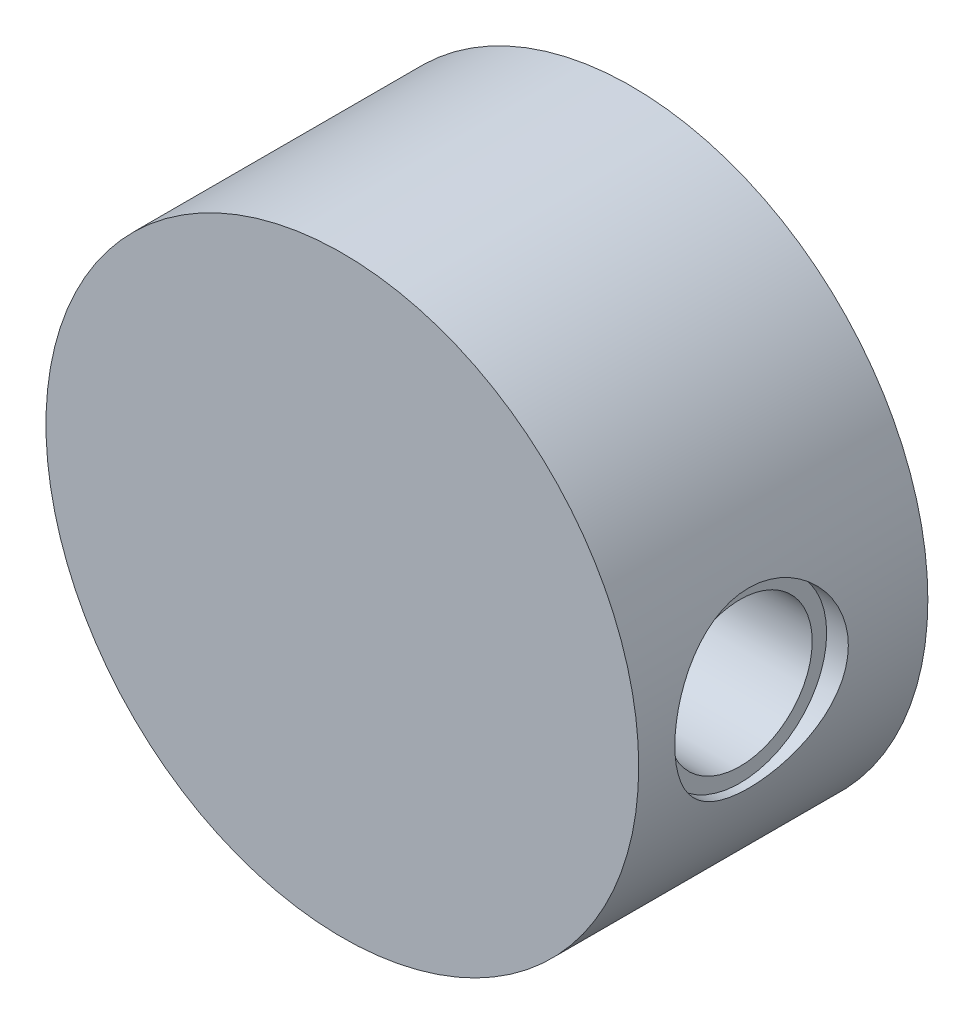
ISO-10303-21;
HEADER;
FILE_DESCRIPTION(('STEP AP214'),'2;1');
FILE_NAME('part.step','',(''),(''),'','','');
FILE_SCHEMA(('AUTOMOTIVE_DESIGN { 1 0 10303 214 1 1 1 1 }'));
ENDSEC;
DATA;
#1=APPLICATION_CONTEXT('core data for automotive mechanical design processes');
#2=APPLICATION_PROTOCOL_DEFINITION('international standard','automotive_design',2000,#1);
#3=PRODUCT_CONTEXT('',#1,'mechanical');
#4=PRODUCT('Part','Part','',(#3));
#5=PRODUCT_RELATED_PRODUCT_CATEGORY('part','',(#4));
#6=PRODUCT_DEFINITION_FORMATION('','',#4);
#7=PRODUCT_DEFINITION_CONTEXT('part definition',#1,'design');
#8=PRODUCT_DEFINITION('design','',#6,#7);
#9=PRODUCT_DEFINITION_SHAPE('','',#8);
#10=(LENGTH_UNIT() NAMED_UNIT(*) SI_UNIT(.MILLI.,.METRE.));
#11=(NAMED_UNIT(*) PLANE_ANGLE_UNIT() SI_UNIT($,.RADIAN.));
#12=(NAMED_UNIT(*) SI_UNIT($,.STERADIAN.) SOLID_ANGLE_UNIT());
#13=UNCERTAINTY_MEASURE_WITH_UNIT(LENGTH_MEASURE(1.E-05),#10,'distance_accuracy_value','');
#14=(GEOMETRIC_REPRESENTATION_CONTEXT(3) GLOBAL_UNCERTAINTY_ASSIGNED_CONTEXT((#13)) GLOBAL_UNIT_ASSIGNED_CONTEXT((#10,
#11,#12)) REPRESENTATION_CONTEXT('',''));
#15=CARTESIAN_POINT('',(0.,0.,0.));
#16=DIRECTION('',(0.,0.,1.));
#17=DIRECTION('',(1.,0.,0.));
#18=AXIS2_PLACEMENT_3D('',#15,#16,#17);
#19=CARTESIAN_POINT('',(0.,0.,0.));
#20=DIRECTION('',(0.,0.,1.));
#21=DIRECTION('',(1.,0.,0.));
#22=AXIS2_PLACEMENT_3D('',#19,#20,#21);
#23=PLANE('',#22);
#24=CARTESIAN_POINT('',(0.,0.,0.));
#25=DIRECTION('',(0.,0.,1.));
#26=DIRECTION('',(1.,0.,0.));
#27=AXIS2_PLACEMENT_3D('',#24,#25,#26);
#28=CIRCLE('',#27,9.5);
#29=CARTESIAN_POINT('',(9.5,0.,0.));
#30=VERTEX_POINT('',#29);
#31=EDGE_CURVE('E8',#30,#30,#28,.T.);
#32=ORIENTED_EDGE('',*,*,#31,.F.);
#33=EDGE_LOOP('',(#32));
#34=FACE_BOUND('',#33,.T.);
#35=CARTESIAN_POINT('',(0.,0.,0.));
#36=DIRECTION('',(0.,0.,-1.));
#37=DIRECTION('',(-1.,0.,0.));
#38=AXIS2_PLACEMENT_3D('',#35,#36,#37);
#39=CIRCLE('',#38,6.);
#40=CARTESIAN_POINT('',(-6.,0.,0.));
#41=VERTEX_POINT('',#40);
#42=EDGE_CURVE('E37',#41,#41,#39,.T.);
#43=ORIENTED_EDGE('',*,*,#42,.F.);
#44=EDGE_LOOP('',(#43));
#45=FACE_BOUND('',#44,.T.);
#46=ADVANCED_FACE('F12',(#34,#45),#23,.F.);
#47=CARTESIAN_POINT('',(0.,0.,40.));
#48=DIRECTION('',(0.,0.,1.));
#49=DIRECTION('',(1.,0.,0.));
#50=AXIS2_PLACEMENT_3D('',#47,#48,#49);
#51=CYLINDRICAL_SURFACE('',#50,9.5);
#52=CARTESIAN_POINT('',(0.,0.,2.));
#53=DIRECTION('',(0.,0.,1.));
#54=DIRECTION('',(1.,0.,0.));
#55=AXIS2_PLACEMENT_3D('',#52,#53,#54);
#56=CIRCLE('',#55,9.5);
#57=CARTESIAN_POINT('',(9.5,0.,2.));
#58=VERTEX_POINT('',#57);
#59=EDGE_CURVE('E34',#58,#58,#56,.T.);
#60=ORIENTED_EDGE('',*,*,#59,.F.);
#61=EDGE_LOOP('',(#60));
#62=FACE_BOUND('',#61,.T.);
#63=ORIENTED_EDGE('',*,*,#31,.T.);
#64=EDGE_LOOP('',(#63));
#65=FACE_BOUND('',#64,.T.);
#66=ADVANCED_FACE('F14',(#62,#65),#51,.T.);
#67=CARTESIAN_POINT('',(20.5,0.,22.));
#68=DIRECTION('',(0.,0.,-1.));
#69=DIRECTION('',(-1.,0.,0.));
#70=AXIS2_PLACEMENT_3D('',#67,#68,#69);
#71=PLANE('',#70);
#72=CARTESIAN_POINT('',(0.,0.,22.));
#73=DIRECTION('',(0.,0.,1.));
#74=DIRECTION('',(1.,0.,0.));
#75=AXIS2_PLACEMENT_3D('',#72,#73,#74);
#76=CIRCLE('',#75,20.5);
#77=CARTESIAN_POINT('',(20.5,0.,22.));
#78=VERTEX_POINT('',#77);
#79=EDGE_CURVE('E25',#78,#78,#76,.T.);
#80=ORIENTED_EDGE('',*,*,#79,.T.);
#81=EDGE_LOOP('',(#80));
#82=FACE_BOUND('',#81,.T.);
#83=ADVANCED_FACE('F73',(#82),#71,.F.);
#84=CARTESIAN_POINT('',(0.,0.,40.));
#85=DIRECTION('',(0.,0.,1.));
#86=DIRECTION('',(1.,0.,0.));
#87=AXIS2_PLACEMENT_3D('',#84,#85,#86);
#88=CYLINDRICAL_SURFACE('',#87,20.5);
#89=CARTESIAN_POINT('',(20.5,0.,7.5));
#90=CARTESIAN_POINT('',(20.4999997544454,-0.164768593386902,7.50000038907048));
#91=CARTESIAN_POINT('',(20.4980087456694,-0.329544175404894,7.50679278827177));
#92=CARTESIAN_POINT('',(20.4900990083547,-0.65788822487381,7.5339021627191));
#93=CARTESIAN_POINT('',(20.4841800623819,-0.821456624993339,7.55421988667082));
#94=CARTESIAN_POINT('',(20.4685766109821,-1.1462122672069,7.60820100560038));
#95=CARTESIAN_POINT('',(20.4588916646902,-1.30739922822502,7.64186596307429));
#96=CARTESIAN_POINT('',(20.4360164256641,-1.62628314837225,7.72226244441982));
#97=CARTESIAN_POINT('',(20.4228249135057,-1.7839788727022,7.76899851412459));
#98=CARTESIAN_POINT('',(20.3933182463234,-2.09448185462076,7.87505403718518));
#99=CARTESIAN_POINT('',(20.3770082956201,-2.24729676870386,7.93435254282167));
#100=CARTESIAN_POINT('',(20.3416823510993,-2.54730770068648,8.06511256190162));
#101=CARTESIAN_POINT('',(20.3226662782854,-2.69450355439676,8.13657443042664));
#102=CARTESIAN_POINT('',(20.2824208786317,-2.98237032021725,8.2911456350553));
#103=CARTESIAN_POINT('',(20.2611910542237,-3.123039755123,8.37425759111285));
#104=CARTESIAN_POINT('',(20.2170775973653,-3.39691169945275,8.55150630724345));
#105=CARTESIAN_POINT('',(20.1941944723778,-3.53011647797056,8.6456396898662));
#106=CARTESIAN_POINT('',(20.146767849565,-3.79154794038,8.84682399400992));
#107=CARTESIAN_POINT('',(20.1221971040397,-3.91956600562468,8.95413966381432));
#108=CARTESIAN_POINT('',(20.0725990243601,-4.1661228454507,9.17897611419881));
#109=CARTESIAN_POINT('',(20.0475718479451,-4.2846648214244,9.29649342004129));
#110=CARTESIAN_POINT('',(19.9977175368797,-4.5116297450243,9.54108035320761));
#111=CARTESIAN_POINT('',(19.9728905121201,-4.62004743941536,9.66815487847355));
#112=CARTESIAN_POINT('',(19.9241410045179,-4.82595045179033,9.93095842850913));
#113=CARTESIAN_POINT('',(19.9002181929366,-4.92343976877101,10.0666842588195));
#114=CARTESIAN_POINT('',(19.8534354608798,-5.10885934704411,10.3490171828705));
#115=CARTESIAN_POINT('',(19.8306098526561,-5.19653638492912,10.4957964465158));
#116=CARTESIAN_POINT('',(19.7872868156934,-5.35913808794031,10.7965125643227));
#117=CARTESIAN_POINT('',(19.766788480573,-5.43406772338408,10.9504465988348));
#118=CARTESIAN_POINT('',(19.7287391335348,-5.57062666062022,11.2645036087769));
#119=CARTESIAN_POINT('',(19.7111887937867,-5.63225293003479,11.4246279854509));
#120=CARTESIAN_POINT('',(19.6796082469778,-5.74162541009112,11.7498143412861));
#121=CARTESIAN_POINT('',(19.6655765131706,-5.78937764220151,11.9148741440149));
#122=CARTESIAN_POINT('',(19.6418018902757,-5.86952471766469,12.2443484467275));
#123=CARTESIAN_POINT('',(19.6319555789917,-5.90229162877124,12.4086649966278));
#124=CARTESIAN_POINT('',(19.6163432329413,-5.95397424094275,12.7395899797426));
#125=CARTESIAN_POINT('',(19.6105755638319,-5.97289549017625,12.9061974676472));
#126=CARTESIAN_POINT('',(19.603301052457,-5.99672775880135,13.2405034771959));
#127=CARTESIAN_POINT('',(19.6017941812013,-6.00163887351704,13.4082019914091));
#128=CARTESIAN_POINT('',(19.6030905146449,-5.99740342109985,13.7434027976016));
#129=CARTESIAN_POINT('',(19.6058936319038,-5.98825713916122,13.9109050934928));
#130=CARTESIAN_POINT('',(19.6155486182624,-5.95655212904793,14.238688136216));
#131=CARTESIAN_POINT('',(19.6222578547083,-5.9344657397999,14.3990190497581));
#132=CARTESIAN_POINT('',(19.6394095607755,-5.87745500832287,14.7172343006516));
#133=CARTESIAN_POINT('',(19.649853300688,-5.84252629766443,14.8751177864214));
#134=CARTESIAN_POINT('',(19.6741615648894,-5.7601395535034,15.187257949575));
#135=CARTESIAN_POINT('',(19.688025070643,-5.71268525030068,15.3415156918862));
#136=CARTESIAN_POINT('',(19.7187796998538,-5.60560692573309,15.6454959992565));
#137=CARTESIAN_POINT('',(19.7356719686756,-5.5459782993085,15.7952168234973));
#138=CARTESIAN_POINT('',(19.7722410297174,-5.41416819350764,16.0910079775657));
#139=CARTESIAN_POINT('',(19.7919506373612,-5.34183608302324,16.2370072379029));
#140=CARTESIAN_POINT('',(19.8334359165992,-5.18568691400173,16.5224423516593));
#141=CARTESIAN_POINT('',(19.8552123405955,-5.10186566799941,16.6618757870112));
#142=CARTESIAN_POINT('',(19.9227548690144,-4.8340177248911,17.0689782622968));
#143=CARTESIAN_POINT('',(19.9707648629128,-4.63350124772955,17.3256854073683));
#144=CARTESIAN_POINT('',(20.0696162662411,-4.18511260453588,17.8126329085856));
#145=CARTESIAN_POINT('',(20.1204944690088,-3.93567819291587,18.0414205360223));
#146=CARTESIAN_POINT('',(20.2176813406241,-3.40132203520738,18.4542852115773));
#147=CARTESIAN_POINT('',(20.2639897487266,-3.11639826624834,18.63835970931));
#148=CARTESIAN_POINT('',(20.3472018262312,-2.51664006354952,18.9573414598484));
#149=CARTESIAN_POINT('',(20.3840462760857,-2.2016334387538,19.0919412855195));
#150=CARTESIAN_POINT('',(20.4437541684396,-1.55212614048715,19.3058343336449));
#151=CARTESIAN_POINT('',(20.4666213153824,-1.21763065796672,19.3851422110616));
#152=CARTESIAN_POINT('',(20.4952175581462,-0.550953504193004,19.4838192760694));
#153=CARTESIAN_POINT('',(20.5015074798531,-0.219085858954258,19.5051506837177));
#154=CARTESIAN_POINT('',(20.4978783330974,0.44350281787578,19.4927506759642));
#155=CARTESIAN_POINT('',(20.4879613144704,0.774223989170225,19.4590262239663));
#156=CARTESIAN_POINT('',(20.4533992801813,1.41781519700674,19.3390673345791));
#157=CARTESIAN_POINT('',(20.4290727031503,1.73091547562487,19.253967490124));
#158=CARTESIAN_POINT('',(20.3684901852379,2.33834273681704,19.0350155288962));
#159=CARTESIAN_POINT('',(20.3322328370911,2.63266749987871,18.901157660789));
#160=CARTESIAN_POINT('',(20.2505580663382,3.201467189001,18.585163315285));
#161=CARTESIAN_POINT('',(20.2049537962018,3.47535043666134,18.4020133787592));
#162=CARTESIAN_POINT('',(20.1098009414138,3.98926947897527,17.9937010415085));
#163=CARTESIAN_POINT('',(20.0602514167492,4.22929716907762,17.7685286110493));
#164=CARTESIAN_POINT('',(19.9860369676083,4.56311282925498,17.3996018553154));
#165=CARTESIAN_POINT('',(19.9608943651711,4.67160496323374,17.2689475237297));
#166=CARTESIAN_POINT('',(19.9116554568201,4.87720494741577,16.9988051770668));
#167=CARTESIAN_POINT('',(19.8875587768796,4.97431688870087,16.8593203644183));
#168=CARTESIAN_POINT('',(19.8411019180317,5.15650338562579,16.5723575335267));
#169=CARTESIAN_POINT('',(19.8187424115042,5.24157329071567,16.4248764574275));
#170=CARTESIAN_POINT('',(19.7764458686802,5.39896546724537,16.1230001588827));
#171=CARTESIAN_POINT('',(19.7565078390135,5.47129297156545,15.9686078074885));
#172=CARTESIAN_POINT('',(19.7197444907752,5.60234699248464,15.6546484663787));
#173=CARTESIAN_POINT('',(19.7029051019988,5.6611353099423,15.49510893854));
#174=CARTESIAN_POINT('',(19.6727610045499,5.76501533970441,15.1713718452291));
#175=CARTESIAN_POINT('',(19.6594548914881,5.81011249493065,15.0071761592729));
#176=CARTESIAN_POINT('',(19.6367999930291,5.88622676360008,14.675294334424));
#177=CARTESIAN_POINT('',(19.6274509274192,5.91724487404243,14.5076084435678));
#178=CARTESIAN_POINT('',(19.6130187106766,5.96490739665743,14.1700260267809));
#179=CARTESIAN_POINT('',(19.6079354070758,5.98155232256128,14.0001295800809));
#180=CARTESIAN_POINT('',(19.6023186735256,5.9999323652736,13.6662567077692));
#181=CARTESIAN_POINT('',(19.6016119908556,6.00223524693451,13.5023141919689));
#182=CARTESIAN_POINT('',(19.6043094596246,5.99341910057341,13.1747666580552));
#183=CARTESIAN_POINT('',(19.6077150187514,5.98229547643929,13.0111617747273));
#184=CARTESIAN_POINT('',(19.6185313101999,5.94672790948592,12.6856110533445));
#185=CARTESIAN_POINT('',(19.6259403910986,5.92228945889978,12.5236645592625));
#186=CARTESIAN_POINT('',(19.6445384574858,5.86030325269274,12.2024601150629));
#187=CARTESIAN_POINT('',(19.6557288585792,5.82275058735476,12.0432031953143));
#188=CARTESIAN_POINT('',(19.6814005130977,5.73537439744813,11.7303823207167));
#189=CARTESIAN_POINT('',(19.6958418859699,5.68569901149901,11.5767736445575));
#190=CARTESIAN_POINT('',(19.7276768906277,5.57423736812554,11.2742707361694));
#191=CARTESIAN_POINT('',(19.7450715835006,5.51244675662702,11.125378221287));
#192=CARTESIAN_POINT('',(19.782319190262,5.37724463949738,10.8333301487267));
#193=CARTESIAN_POINT('',(19.802171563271,5.30383568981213,10.6901733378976));
#194=CARTESIAN_POINT('',(19.8438063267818,5.14587421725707,10.4103722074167));
#195=CARTESIAN_POINT('',(19.8655894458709,5.061317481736,10.2737303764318));
#196=CARTESIAN_POINT('',(19.9112797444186,4.87853600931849,10.0032239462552));
#197=CARTESIAN_POINT('',(19.9352342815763,4.77994030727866,9.86961789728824));
#198=CARTESIAN_POINT('',(19.9839347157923,4.57206196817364,9.61107007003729));
#199=CARTESIAN_POINT('',(20.0086809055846,4.46277534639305,9.48613155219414));
#200=CARTESIAN_POINT('',(20.0582834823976,4.23425660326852,9.24575891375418));
#201=CARTESIAN_POINT('',(20.0831398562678,4.11502564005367,9.13032368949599));
#202=CARTESIAN_POINT('',(20.1323098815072,3.86730499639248,8.90963180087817));
#203=CARTESIAN_POINT('',(20.1566233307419,3.7388119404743,8.80437888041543));
#204=CARTESIAN_POINT('',(20.2046974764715,3.46977987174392,8.6020699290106));
#205=CARTESIAN_POINT('',(20.2284250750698,3.32900807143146,8.50531528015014));
#206=CARTESIAN_POINT('',(20.2739466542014,3.03949915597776,8.32403500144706));
#207=CARTESIAN_POINT('',(20.2957406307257,2.8907620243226,8.23950939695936));
#208=CARTESIAN_POINT('',(20.3367679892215,2.58639447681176,8.0833769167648));
#209=CARTESIAN_POINT('',(20.356002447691,2.43076699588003,8.01176460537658));
#210=CARTESIAN_POINT('',(20.3913677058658,2.11366097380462,7.88201306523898));
#211=CARTESIAN_POINT('',(20.4074988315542,1.95218304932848,7.82387242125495));
#212=CARTESIAN_POINT('',(20.4344672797,1.64423058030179,7.72771145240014));
#213=CARTESIAN_POINT('',(20.4457076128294,1.49828162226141,7.68811373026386));
#214=CARTESIAN_POINT('',(20.4651675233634,1.2036242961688,7.62002138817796));
#215=CARTESIAN_POINT('',(20.4733873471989,1.0549161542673,7.59152586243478));
#216=CARTESIAN_POINT('',(20.4866168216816,0.755624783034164,7.54584620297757));
#217=CARTESIAN_POINT('',(20.491626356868,0.605041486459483,7.52866247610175));
#218=CARTESIAN_POINT('',(20.49831762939,0.302973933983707,7.50574067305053));
#219=CARTESIAN_POINT('',(20.5000002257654,0.151489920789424,7.49999964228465));
#220=CARTESIAN_POINT('',(20.5,0.,7.5));
#221=B_SPLINE_CURVE_WITH_KNOTS('',3,(#89,#90,#91,#92,#93,#94,#95,#96,#97,#98,#99,#100,#101,#102,
#103,#104,#105,#106,#107,#108,#109,#110,#111,#112,#113,#114,#115,#116,#117,#118,#119,#120,#121,
#122,#123,#124,#125,#126,#127,#128,#129,#130,#131,#132,#133,#134,#135,#136,#137,#138,#139,#140,
#141,#142,#143,#144,#145,#146,#147,#148,#149,#150,#151,#152,#153,#154,#155,#156,#157,#158,#159,
#160,#161,#162,#163,#164,#165,#166,#167,#168,#169,#170,#171,#172,#173,#174,#175,#176,#177,#178,
#179,#180,#181,#182,#183,#184,#185,#186,#187,#188,#189,#190,#191,#192,#193,#194,#195,#196,#197,
#198,#199,#200,#201,#202,#203,#204,#205,#206,#207,#208,#209,#210,#211,#212,#213,#214,#215,#216,
#217,#218,#219,#220),.UNSPECIFIED.,.T.,.F.,(4,2,2,2,2,2,2,2,2,2,2,2,2,2,2,2,2,2,2,2,2,2,2,2,2,2,
2,2,2,2,2,2,2,2,2,2,2,2,2,2,2,2,2,2,2,2,2,2,2,2,2,2,2,2,2,2,2,2,2,2,2,2,2,2,2,4),(0.,
0.494166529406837,0.988360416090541,1.48261217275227,1.97703603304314,2.47064184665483,
2.96426207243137,3.45799348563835,3.95157399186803,4.45753270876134,4.96331976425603,
5.46936781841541,5.97523008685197,6.49206535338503,7.00869863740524,7.52544955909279,
8.04197586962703,8.54486934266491,9.04756118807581,9.55024961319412,10.0529278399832,
10.5383093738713,11.0238561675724,11.5092585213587,11.9948448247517,12.4866344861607,
12.9786038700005,13.9617709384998,14.9839152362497,16.006117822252,17.0345689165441,
18.062747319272,19.0556662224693,20.0484595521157,21.0200911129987,21.9918373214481,
22.9853318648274,23.97906383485,24.4935931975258,25.0079370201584,25.5224789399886,
26.0368090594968,26.5487427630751,27.0604726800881,27.5721663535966,28.0838417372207,
28.5751252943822,29.066577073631,29.5578262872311,30.0492596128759,30.5349645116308,
31.0208442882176,31.5066173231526,31.9925744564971,32.4953010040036,32.9982156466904,
33.5010718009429,34.0041121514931,34.5208552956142,35.0375995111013,35.5541256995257,
36.0705976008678,36.525077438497,36.9795201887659,37.4339792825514,37.8883210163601),.UNSPECIFIED.);
#222=CARTESIAN_POINT('',(20.5,0.,7.5));
#223=VERTEX_POINT('',#222);
#224=EDGE_CURVE('E16',#223,#223,#221,.T.);
#225=ORIENTED_EDGE('',*,*,#224,.T.);
#226=EDGE_LOOP('',(#225));
#227=FACE_BOUND('',#226,.T.);
#228=ORIENTED_EDGE('',*,*,#79,.F.);
#229=EDGE_LOOP('',(#228));
#230=FACE_BOUND('',#229,.T.);
#231=CARTESIAN_POINT('',(0.,0.,2.));
#232=DIRECTION('',(0.,0.,1.));
#233=DIRECTION('',(1.,0.,0.));
#234=AXIS2_PLACEMENT_3D('',#231,#232,#233);
#235=CIRCLE('',#234,20.5);
#236=CARTESIAN_POINT('',(20.5,0.,2.));
#237=VERTEX_POINT('',#236);
#238=EDGE_CURVE('E29',#237,#237,#235,.T.);
#239=ORIENTED_EDGE('',*,*,#238,.T.);
#240=EDGE_LOOP('',(#239));
#241=FACE_BOUND('',#240,.T.);
#242=ADVANCED_FACE('F69',(#227,#230,#241),#88,.T.);
#243=CARTESIAN_POINT('',(9.5,0.,2.));
#244=DIRECTION('',(0.,0.,1.));
#245=DIRECTION('',(1.,0.,0.));
#246=AXIS2_PLACEMENT_3D('',#243,#244,#245);
#247=PLANE('',#246);
#248=ORIENTED_EDGE('',*,*,#238,.F.);
#249=EDGE_LOOP('',(#248));
#250=FACE_BOUND('',#249,.T.);
#251=ORIENTED_EDGE('',*,*,#59,.T.);
#252=EDGE_LOOP('',(#251));
#253=FACE_BOUND('',#252,.T.);
#254=ADVANCED_FACE('F72',(#250,#253),#247,.F.);
#255=CARTESIAN_POINT('',(0.,0.,0.));
#256=DIRECTION('',(0.,0.,-1.));
#257=DIRECTION('',(-1.,0.,0.));
#258=AXIS2_PLACEMENT_3D('',#255,#256,#257);
#259=CYLINDRICAL_SURFACE('',#258,6.);
#260=ORIENTED_EDGE('',*,*,#42,.T.);
#261=EDGE_LOOP('',(#260));
#262=FACE_BOUND('',#261,.T.);
#263=CARTESIAN_POINT('',(0.,0.,21.));
#264=DIRECTION('',(0.,0.,-1.));
#265=DIRECTION('',(-1.,0.,0.));
#266=AXIS2_PLACEMENT_3D('',#263,#264,#265);
#267=CIRCLE('',#266,6.);
#268=CARTESIAN_POINT('',(-6.,0.,21.));
#269=VERTEX_POINT('',#268);
#270=EDGE_CURVE('E40',#269,#269,#267,.T.);
#271=ORIENTED_EDGE('',*,*,#270,.F.);
#272=EDGE_LOOP('',(#271));
#273=FACE_BOUND('',#272,.T.);
#274=ADVANCED_FACE('F80',(#262,#273),#259,.F.);
#275=CARTESIAN_POINT('',(0.,0.,21.));
#276=DIRECTION('',(0.,0.,-1.));
#277=DIRECTION('',(-1.,0.,0.));
#278=AXIS2_PLACEMENT_3D('',#275,#276,#277);
#279=PLANE('',#278);
#280=ORIENTED_EDGE('',*,*,#270,.T.);
#281=EDGE_LOOP('',(#280));
#282=FACE_BOUND('',#281,.T.);
#283=ADVANCED_FACE('F64',(#282),#279,.T.);
#284=CARTESIAN_POINT('',(19.,0.,13.5));
#285=DIRECTION('',(1.,0.,0.));
#286=DIRECTION('',(0.,0.,-1.));
#287=AXIS2_PLACEMENT_3D('',#284,#285,#286);
#288=CYLINDRICAL_SURFACE('',#287,6.);
#289=CARTESIAN_POINT('',(19.,0.,13.5));
#290=DIRECTION('',(1.,0.,0.));
#291=DIRECTION('',(0.,0.,-1.));
#292=AXIS2_PLACEMENT_3D('',#289,#290,#291);
#293=CIRCLE('',#292,6.);
#294=CARTESIAN_POINT('',(19.,0.,7.5));
#295=VERTEX_POINT('',#294);
#296=EDGE_CURVE('E43',#295,#295,#293,.T.);
#297=ORIENTED_EDGE('',*,*,#296,.F.);
#298=EDGE_LOOP('',(#297));
#299=FACE_BOUND('',#298,.T.);
#300=ORIENTED_EDGE('',*,*,#224,.F.);
#301=EDGE_LOOP('',(#300));
#302=FACE_BOUND('',#301,.T.);
#303=ADVANCED_FACE('F58',(#299,#302),#288,.F.);
#304=CARTESIAN_POINT('',(19.,0.,13.5));
#305=DIRECTION('',(1.,0.,0.));
#306=DIRECTION('',(0.,0.,-1.));
#307=AXIS2_PLACEMENT_3D('',#304,#305,#306);
#308=PLANE('',#307);
#309=CARTESIAN_POINT('',(19.,0.,13.5));
#310=DIRECTION('',(1.,0.,0.));
#311=DIRECTION('',(0.,0.,-1.));
#312=AXIS2_PLACEMENT_3D('',#309,#310,#311);
#313=CIRCLE('',#312,5.);
#314=CARTESIAN_POINT('',(19.,0.,8.5));
#315=VERTEX_POINT('',#314);
#316=EDGE_CURVE('E49',#315,#315,#313,.T.);
#317=ORIENTED_EDGE('',*,*,#316,.F.);
#318=EDGE_LOOP('',(#317));
#319=FACE_BOUND('',#318,.T.);
#320=ORIENTED_EDGE('',*,*,#296,.T.);
#321=EDGE_LOOP('',(#320));
#322=FACE_BOUND('',#321,.T.);
#323=ADVANCED_FACE('F55',(#319,#322),#308,.T.);
#324=CARTESIAN_POINT('',(10.,0.,13.5));
#325=DIRECTION('',(1.,0.,0.));
#326=DIRECTION('',(0.,0.,-1.));
#327=AXIS2_PLACEMENT_3D('',#324,#325,#326);
#328=CYLINDRICAL_SURFACE('',#327,5.);
#329=CARTESIAN_POINT('',(10.,0.,13.5));
#330=DIRECTION('',(1.,0.,0.));
#331=DIRECTION('',(0.,0.,-1.));
#332=AXIS2_PLACEMENT_3D('',#329,#330,#331);
#333=CIRCLE('',#332,5.);
#334=CARTESIAN_POINT('',(10.,0.,8.5));
#335=VERTEX_POINT('',#334);
#336=EDGE_CURVE('E46',#335,#335,#333,.T.);
#337=ORIENTED_EDGE('',*,*,#336,.F.);
#338=EDGE_LOOP('',(#337));
#339=FACE_BOUND('',#338,.T.);
#340=ORIENTED_EDGE('',*,*,#316,.T.);
#341=EDGE_LOOP('',(#340));
#342=FACE_BOUND('',#341,.T.);
#343=ADVANCED_FACE('F53',(#339,#342),#328,.F.);
#344=CARTESIAN_POINT('',(10.,0.,13.5));
#345=DIRECTION('',(1.,0.,0.));
#346=DIRECTION('',(0.,0.,-1.));
#347=AXIS2_PLACEMENT_3D('',#344,#345,#346);
#348=PLANE('',#347);
#349=ORIENTED_EDGE('',*,*,#336,.T.);
#350=EDGE_LOOP('',(#349));
#351=FACE_BOUND('',#350,.T.);
#352=ADVANCED_FACE('F109',(#351),#348,.T.);
#353=CLOSED_SHELL('',(#46,#66,#83,#242,#254,#274,#283,#303,#323,#343,#352));
#354=MANIFOLD_SOLID_BREP('B1',#353);
#355=ADVANCED_BREP_SHAPE_REPRESENTATION('',(#18,#354),#14);
#356=SHAPE_DEFINITION_REPRESENTATION(#9,#355);
ENDSEC;
END-ISO-10303-21;
